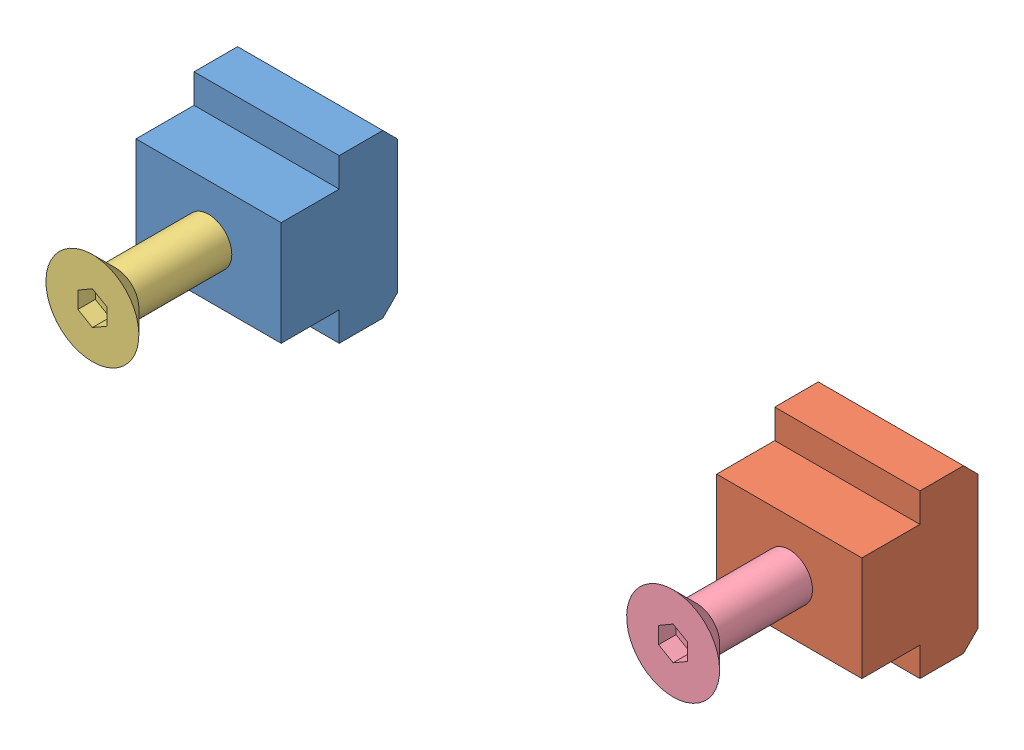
SolidWorks assembly MVAC110T18.sldasm, configuration Default (file format 15000). Lengths in mm.
Overall size (125 28 40).
4 component instances, 4 part files, 0 mates.
Components (placement in the parent):
- MVAC110T18_01-1: MVAC110T18_01.sldprt [ﾃﾞﾌｫﾙﾄ] at origin size (25 28 20)
- MVAC110T18_02-1: MVAC110T18_02.sldprt [ﾃﾞﾌｫﾙﾄ] at (100 0 0) size (25 28 20)
- MVAC110T18_03-1: MVAC110T18_03.sldprt [ﾃﾞﾌｫﾙﾄ] at (0 0 30) size (16 16 40)
- MVAC110T18_04-1: MVAC110T18_04.sldprt [ﾃﾞﾌｫﾙﾄ] at (100 0 30) size (16 16 40)
